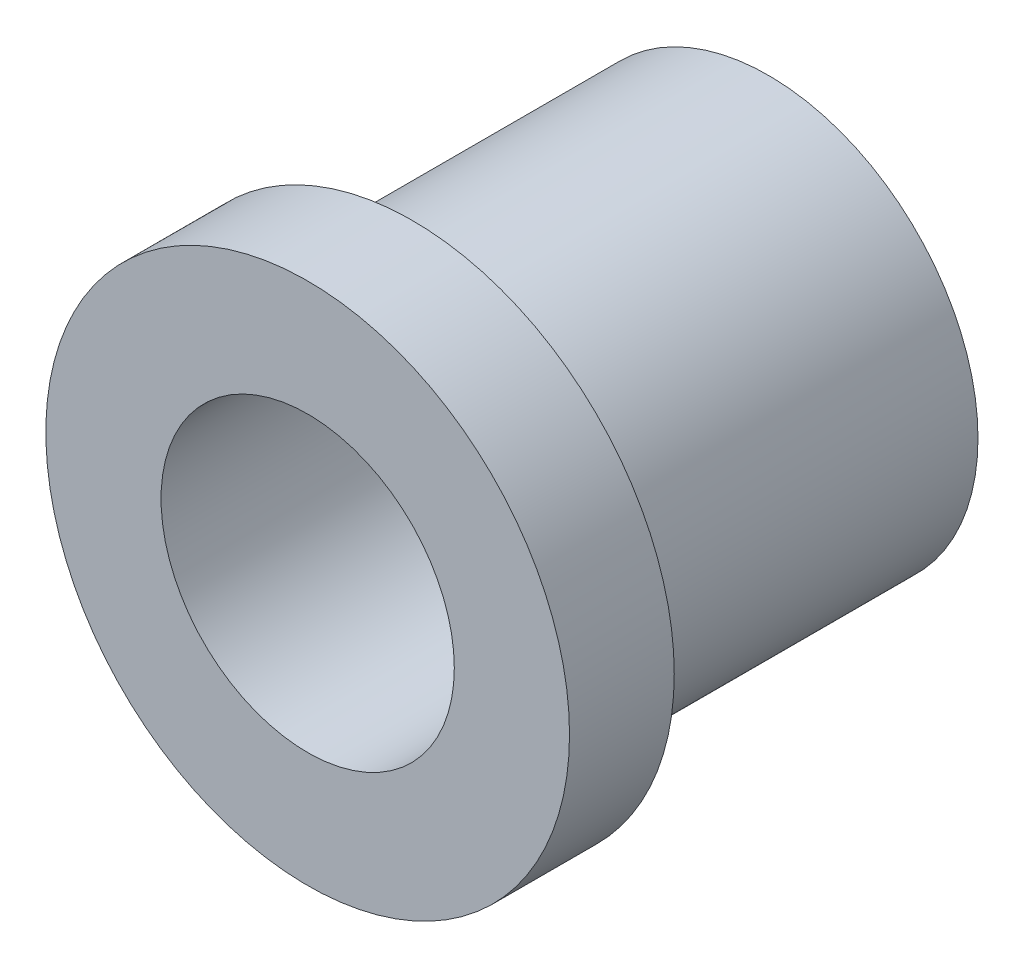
ISO-10303-21;
HEADER;
FILE_DESCRIPTION(('STEP AP214'),'2;1');
FILE_NAME('part.step','',(''),(''),'','','');
FILE_SCHEMA(('AUTOMOTIVE_DESIGN { 1 0 10303 214 1 1 1 1 }'));
ENDSEC;
DATA;
#1=APPLICATION_CONTEXT('core data for automotive mechanical design processes');
#2=APPLICATION_PROTOCOL_DEFINITION('international standard','automotive_design',2000,#1);
#3=PRODUCT_CONTEXT('',#1,'mechanical');
#4=PRODUCT('Part','Part','',(#3));
#5=PRODUCT_RELATED_PRODUCT_CATEGORY('part','',(#4));
#6=PRODUCT_DEFINITION_FORMATION('','',#4);
#7=PRODUCT_DEFINITION_CONTEXT('part definition',#1,'design');
#8=PRODUCT_DEFINITION('design','',#6,#7);
#9=PRODUCT_DEFINITION_SHAPE('','',#8);
#10=(LENGTH_UNIT() NAMED_UNIT(*) SI_UNIT(.MILLI.,.METRE.));
#11=(NAMED_UNIT(*) PLANE_ANGLE_UNIT() SI_UNIT($,.RADIAN.));
#12=(NAMED_UNIT(*) SI_UNIT($,.STERADIAN.) SOLID_ANGLE_UNIT());
#13=UNCERTAINTY_MEASURE_WITH_UNIT(LENGTH_MEASURE(1.E-05),#10,'distance_accuracy_value','');
#14=(GEOMETRIC_REPRESENTATION_CONTEXT(3) GLOBAL_UNCERTAINTY_ASSIGNED_CONTEXT((#13)) GLOBAL_UNIT_ASSIGNED_CONTEXT((#10,
#11,#12)) REPRESENTATION_CONTEXT('',''));
#15=CARTESIAN_POINT('',(0.,0.,0.));
#16=DIRECTION('',(0.,0.,1.));
#17=DIRECTION('',(1.,0.,0.));
#18=AXIS2_PLACEMENT_3D('',#15,#16,#17);
#19=CARTESIAN_POINT('',(0.,0.,1.1));
#20=DIRECTION('',(0.,0.,1.));
#21=DIRECTION('',(1.,0.,0.));
#22=AXIS2_PLACEMENT_3D('',#19,#20,#21);
#23=CYLINDRICAL_SURFACE('',#22,12.5);
#24=CARTESIAN_POINT('',(0.,0.,-5.00000000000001));
#25=DIRECTION('',(0.,0.,1.));
#26=DIRECTION('',(1.,0.,0.));
#27=AXIS2_PLACEMENT_3D('',#24,#25,#26);
#28=CIRCLE('',#27,12.5);
#29=CARTESIAN_POINT('',(12.5,0.,-5.00000000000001));
#30=VERTEX_POINT('',#29);
#31=EDGE_CURVE('E10',#30,#30,#28,.T.);
#32=ORIENTED_EDGE('',*,*,#31,.T.);
#33=EDGE_LOOP('',(#32));
#34=FACE_BOUND('',#33,.T.);
#35=CARTESIAN_POINT('',(0.,0.,0.));
#36=DIRECTION('',(0.,0.,1.));
#37=DIRECTION('',(1.,0.,0.));
#38=AXIS2_PLACEMENT_3D('',#35,#36,#37);
#39=CIRCLE('',#38,12.5);
#40=CARTESIAN_POINT('',(12.5,0.,0.));
#41=VERTEX_POINT('',#40);
#42=EDGE_CURVE('E51',#41,#41,#39,.T.);
#43=ORIENTED_EDGE('',*,*,#42,.F.);
#44=EDGE_LOOP('',(#43));
#45=FACE_BOUND('',#44,.T.);
#46=ADVANCED_FACE('F29',(#34,#45),#23,.T.);
#47=CARTESIAN_POINT('',(12.5,0.,-5.00000000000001));
#48=DIRECTION('',(0.,0.,-1.));
#49=DIRECTION('',(-1.,0.,0.));
#50=AXIS2_PLACEMENT_3D('',#47,#48,#49);
#51=PLANE('',#50);
#52=CARTESIAN_POINT('',(0.,0.,-5.00000000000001));
#53=DIRECTION('',(0.,0.,1.));
#54=DIRECTION('',(1.,0.,0.));
#55=AXIS2_PLACEMENT_3D('',#52,#53,#54);
#56=CIRCLE('',#55,10.);
#57=CARTESIAN_POINT('',(10.,0.,-5.00000000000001));
#58=VERTEX_POINT('',#57);
#59=EDGE_CURVE('E35',#58,#58,#56,.T.);
#60=ORIENTED_EDGE('',*,*,#59,.T.);
#61=EDGE_LOOP('',(#60));
#62=FACE_BOUND('',#61,.T.);
#63=ORIENTED_EDGE('',*,*,#31,.F.);
#64=EDGE_LOOP('',(#63));
#65=FACE_BOUND('',#64,.T.);
#66=ADVANCED_FACE('F59',(#62,#65),#51,.T.);
#67=CARTESIAN_POINT('',(0.,0.,1.1));
#68=DIRECTION('',(0.,0.,1.));
#69=DIRECTION('',(1.,0.,0.));
#70=AXIS2_PLACEMENT_3D('',#67,#68,#69);
#71=CYLINDRICAL_SURFACE('',#70,10.);
#72=CARTESIAN_POINT('',(0.,0.,-22.));
#73=DIRECTION('',(0.,0.,1.));
#74=DIRECTION('',(1.,0.,0.));
#75=AXIS2_PLACEMENT_3D('',#72,#73,#74);
#76=CIRCLE('',#75,10.);
#77=CARTESIAN_POINT('',(10.,0.,-22.));
#78=VERTEX_POINT('',#77);
#79=EDGE_CURVE('E39',#78,#78,#76,.T.);
#80=ORIENTED_EDGE('',*,*,#79,.T.);
#81=EDGE_LOOP('',(#80));
#82=FACE_BOUND('',#81,.T.);
#83=ORIENTED_EDGE('',*,*,#59,.F.);
#84=EDGE_LOOP('',(#83));
#85=FACE_BOUND('',#84,.T.);
#86=ADVANCED_FACE('F63',(#82,#85),#71,.T.);
#87=CARTESIAN_POINT('',(10.,0.,-22.));
#88=DIRECTION('',(0.,0.,-1.));
#89=DIRECTION('',(-1.,0.,0.));
#90=AXIS2_PLACEMENT_3D('',#87,#88,#89);
#91=PLANE('',#90);
#92=CARTESIAN_POINT('',(0.,0.,-22.));
#93=DIRECTION('',(0.,0.,1.));
#94=DIRECTION('',(1.,0.,0.));
#95=AXIS2_PLACEMENT_3D('',#92,#93,#94);
#96=CIRCLE('',#95,7.);
#97=CARTESIAN_POINT('',(7.,0.,-22.));
#98=VERTEX_POINT('',#97);
#99=EDGE_CURVE('E43',#98,#98,#96,.T.);
#100=ORIENTED_EDGE('',*,*,#99,.T.);
#101=EDGE_LOOP('',(#100));
#102=FACE_BOUND('',#101,.T.);
#103=ORIENTED_EDGE('',*,*,#79,.F.);
#104=EDGE_LOOP('',(#103));
#105=FACE_BOUND('',#104,.T.);
#106=ADVANCED_FACE('F67',(#102,#105),#91,.T.);
#107=CARTESIAN_POINT('',(0.,0.,1.1));
#108=DIRECTION('',(0.,0.,1.));
#109=DIRECTION('',(1.,0.,0.));
#110=AXIS2_PLACEMENT_3D('',#107,#108,#109);
#111=CYLINDRICAL_SURFACE('',#110,7.);
#112=CARTESIAN_POINT('',(0.,0.,0.));
#113=DIRECTION('',(0.,0.,1.));
#114=DIRECTION('',(1.,0.,0.));
#115=AXIS2_PLACEMENT_3D('',#112,#113,#114);
#116=CIRCLE('',#115,7.);
#117=CARTESIAN_POINT('',(7.,0.,0.));
#118=VERTEX_POINT('',#117);
#119=EDGE_CURVE('E48',#118,#118,#116,.T.);
#120=ORIENTED_EDGE('',*,*,#119,.T.);
#121=EDGE_LOOP('',(#120));
#122=FACE_BOUND('',#121,.T.);
#123=ORIENTED_EDGE('',*,*,#99,.F.);
#124=EDGE_LOOP('',(#123));
#125=FACE_BOUND('',#124,.T.);
#126=ADVANCED_FACE('F74',(#122,#125),#111,.F.);
#127=CARTESIAN_POINT('',(7.,0.,0.));
#128=DIRECTION('',(0.,0.,1.));
#129=DIRECTION('',(1.,0.,0.));
#130=AXIS2_PLACEMENT_3D('',#127,#128,#129);
#131=PLANE('',#130);
#132=ORIENTED_EDGE('',*,*,#42,.T.);
#133=EDGE_LOOP('',(#132));
#134=FACE_BOUND('',#133,.T.);
#135=ORIENTED_EDGE('',*,*,#119,.F.);
#136=EDGE_LOOP('',(#135));
#137=FACE_BOUND('',#136,.T.);
#138=ADVANCED_FACE('F55',(#134,#137),#131,.T.);
#139=CLOSED_SHELL('',(#46,#66,#86,#106,#126,#138));
#140=MANIFOLD_SOLID_BREP('B2',#139);
#141=ADVANCED_BREP_SHAPE_REPRESENTATION('',(#18,#140),#14);
#142=SHAPE_DEFINITION_REPRESENTATION(#9,#141);
ENDSEC;
END-ISO-10303-21;
